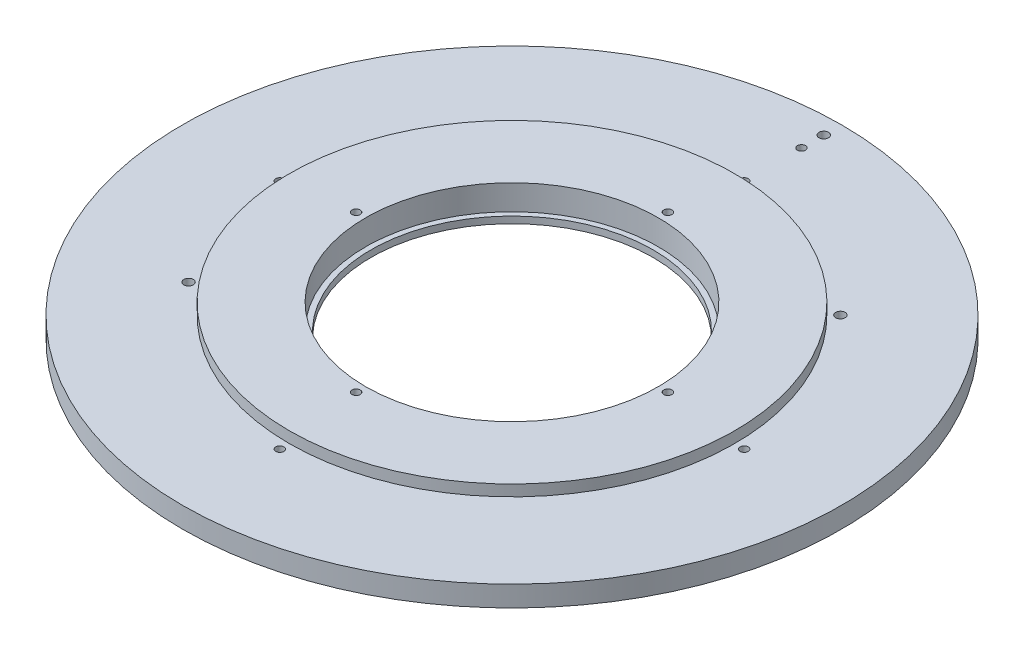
from build123d import *

# Parameters (mm, degrees)
SKETCH3_R          = 164.4579332
BASE_EXTRUDE_DEPTH = 15.875
SKETCH4_R          = 182.5625
SKETCH4_R_2        = 111.125
CUT_EXTRUDE1_DEPTH = 5.55625
SKETCH6_R          = 73.03135
CUT_EXTRUDE2_DEPTH = 12.5476
SKETCH7_R          = 70.4215
CUT_EXTRUDE3_DEPTH = 233.916864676
TAP10_321_D        = 4.0386
TAP10_321_DEPTH    = 24.13
TAP10_321_TIP      = 1.213317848
TAP10_322_D        = 4.0386
TAP10_322_DEPTH    = 24.13
TAP10_322_TIP      = 1.213317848
TAP10_323_D        = 4.0386
TAP10_323_DEPTH    = 24.13
TAP10_323_TIP      = 1.213317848
TAP10_324_D        = 4.0386
TAP10_324_DEPTH    = 24.13
TAP10_324_TIP      = 1.213317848
TAP10_325_D        = 4.0386
TAP10_325_DEPTH    = 24.13
TAP10_325_TIP      = 1.213317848
TAP10_326_D        = 4.0386
TAP10_326_DEPTH    = 24.13
TAP10_326_TIP      = 1.213317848
TAP10_327_D        = 4.0386
TAP10_327_DEPTH    = 24.13
TAP10_327_TIP      = 1.213317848
TAP10_328_D        = 4.0386
TAP10_328_DEPTH    = 24.13
TAP10_328_TIP      = 1.213317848
HOLE9_D            = 4.365625
HOLE9_DEPTH        = 203.2
HOLE9_CBORE_D      = 4.7371
HOLE9_CBORE_DEPTH  = 14.2875
HOLE10_D           = 4.365625
HOLE10_DEPTH       = 203.2
HOLE10_CBORE_D     = 4.7371
HOLE10_CBORE_DEPTH = 14.2875
TAP10_329_D        = 4.0386
TAP10_329_DEPTH    = 24.13
TAP10_329_TIP      = 1.213317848
HOLE13_D           = 4.365625
HOLE13_DEPTH       = 14.2875
HOLE13_CBORE_D     = 4.7879
HOLE13_CBORE_DEPTH = 7.14375
HOLE13_TIP         = 1.31156607


with BuildPart() as part:
    # Sketch3 → Base-Extrude (new body)
    with BuildSketch(Plane(origin=(0, 1203.325, 0), x_dir=(-1, 0, 0), z_dir=(0, 1, 0))):
        with Locations(Location((0, 0, 0), (0, 0, 90))):
            Circle(SKETCH3_R)
    extrude(amount=BASE_EXTRUDE_DEPTH)

    # Sketch4 → Cut-Extrude1 (cut)
    with BuildSketch(Plane(origin=(0, 1219.2, 0), x_dir=(-1, 0, 0), z_dir=(0, 1, 0))):
        Circle(SKETCH4_R)
        with Locations(Location((0, 0, 0), (0, 0, 90))):
            Circle(SKETCH4_R_2, mode=Mode.SUBTRACT)
    extrude(amount=-CUT_EXTRUDE1_DEPTH, mode=Mode.SUBTRACT)

    # Sketch6 → Cut-Extrude2 (cut)
    with BuildSketch(Plane(origin=(0, 1219.2, 0), x_dir=(-1, 0, 0), z_dir=(0, 1, 0))):
        with Locations(Location((0, 0, 0), (0, 0, 90))):
            Circle(SKETCH6_R)
    extrude(amount=-CUT_EXTRUDE2_DEPTH, mode=Mode.SUBTRACT)

    # Sketch7 → Cut-Extrude3 (cut, through all)
    with BuildSketch(Plane(origin=(0, 1206.6524, 0), x_dir=(-1, 0, 0), z_dir=(0, 1, 0))):
        with Locations(Location((0, 0, 0), (0, 0, 90))):
            Circle(SKETCH7_R)
    extrude(amount=-CUT_EXTRUDE3_DEPTH, mode=Mode.SUBTRACT)

    # TAP10-321
    with Locations(Plane(origin=(-78.634775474, 1219.2, 20.274342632), x_dir=(-1, 0, 0), z_dir=(0, 1, 0))):
        with Locations((-0.847275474, -20.274342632)):
            Hole(TAP10_321_D / 2, depth=TAP10_321_DEPTH)
            with Locations((0, 0, -(TAP10_321_DEPTH + TAP10_321_TIP / 2))):  # 118° drill point
                Cone(0, TAP10_321_D / 2, TAP10_321_TIP, mode=Mode.SUBTRACT)

    # TAP10-322
    with Locations(Plane(origin=(11.50472924, 1219.2, 113.710884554), x_dir=(-1, 0, 0), z_dir=(0, 1, 0))):
        with Locations((11.50472924, -35.923384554)):
            Hole(TAP10_322_D / 2, depth=TAP10_322_DEPTH)
            with Locations((0, 0, -(TAP10_322_DEPTH + TAP10_322_TIP / 2))):  # 118° drill point
                Cone(0, TAP10_322_D / 2, TAP10_322_TIP, mode=Mode.SUBTRACT)

    # TAP10-323
    with Locations(Plane(origin=(89.973441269, 1219.2, 37.689853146), x_dir=(-1, 0, 0), z_dir=(0, 1, 0))):
        with Locations((12.185941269, -37.689853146)):
            Hole(TAP10_323_D / 2, depth=TAP10_323_DEPTH)
            with Locations((0, 0, -(TAP10_323_DEPTH + TAP10_323_TIP / 2))):  # 118° drill point
                Cone(0, TAP10_323_D / 2, TAP10_323_TIP, mode=Mode.SUBTRACT)

    # TAP10-324
    with Locations(Plane(origin=(11.243582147, 1219.2, -53.286144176), x_dir=(-1, 0, 0), z_dir=(0, 1, 0))):
        with Locations((11.243582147, -24.501355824)):
            Hole(TAP10_324_D / 2, depth=TAP10_324_DEPTH)
            with Locations((0, 0, -(TAP10_324_DEPTH + TAP10_324_TIP / 2))):  # 118° drill point
                Cone(0, TAP10_324_D / 2, TAP10_324_TIP, mode=Mode.SUBTRACT)

    # TAP10-325
    with Locations(Plane(origin=(9.422599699, 1213.64375, 147.124641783), x_dir=(-1, 0, 0), z_dir=(0, 1, 0))):
        with Locations((9.422599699, -31.237141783)):
            Hole(TAP10_325_D / 2, depth=TAP10_325_DEPTH)
            with Locations((0, 0, -(TAP10_325_DEPTH + TAP10_325_TIP / 2))):  # 118° drill point
                Cone(0, TAP10_325_D / 2, TAP10_325_TIP, mode=Mode.SUBTRACT)

    # TAP10-326
    with Locations(Plane(origin=(122.114111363, 1213.64375, 30.988319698), x_dir=(-1, 0, 0), z_dir=(0, 1, 0))):
        with Locations((6.226611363, -30.988319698)):
            Hole(TAP10_326_D / 2, depth=TAP10_326_DEPTH)
            with Locations((0, 0, -(TAP10_326_DEPTH + TAP10_326_TIP / 2))):  # 118° drill point
                Cone(0, TAP10_326_D / 2, TAP10_326_TIP, mode=Mode.SUBTRACT)

    # TAP10-327
    with Locations(Plane(origin=(7.463888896, 1213.64375, -88.482536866), x_dir=(-1, 0, 0), z_dir=(0, 1, 0))):
        with Locations((7.463888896, -27.404963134)):
            Hole(TAP10_327_D / 2, depth=TAP10_327_DEPTH)
            with Locations((0, 0, -(TAP10_327_DEPTH + TAP10_327_TIP / 2))):  # 118° drill point
                Cone(0, TAP10_327_D / 2, TAP10_327_TIP, mode=Mode.SUBTRACT)

    # TAP10-328
    with Locations(Plane(origin=(-113.643602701, 1213.64375, 30.817654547), x_dir=(-1, 0, 0), z_dir=(0, 1, 0))):
        with Locations((2.243897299, -30.817654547)):
            Hole(TAP10_328_D / 2, depth=TAP10_328_DEPTH)
            with Locations((0, 0, -(TAP10_328_DEPTH + TAP10_328_TIP / 2))):  # 118° drill point
                Cone(0, TAP10_328_D / 2, TAP10_328_TIP, mode=Mode.SUBTRACT)

    # Hole9
    with Locations(Plane(origin=(95.279391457, 1213.64375, -58.290093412), x_dir=(-1, 0, 0), z_dir=(0, 1, 0))):
        with Locations((13.334554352, -23.654743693)):
            CounterBoreHole(HOLE9_D / 2, HOLE9_CBORE_D / 2, HOLE9_CBORE_DEPTH, depth=HOLE9_DEPTH)

    # Hole10
    with Locations(Plane(origin=(-97.262405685, 1213.64375, 91.550407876), x_dir=(-1, 0, 0), z_dir=(0, 1, 0))):
        with Locations((-2.332923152, -25.080068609)):
            CounterBoreHole(HOLE10_D / 2, HOLE10_CBORE_D / 2, HOLE10_CBORE_DEPTH, depth=HOLE10_DEPTH)

    # TAP10-329
    with Locations(Plane(origin=(-7.506670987, 1213.64375, -118.718492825), x_dir=(-1, 0, 0), z_dir=(0, 1, 0))):
        with Locations((-7.506670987, -25.744007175)):
            Hole(TAP10_329_D / 2, depth=TAP10_329_DEPTH)
            with Locations((0, 0, -(TAP10_329_DEPTH + TAP10_329_TIP / 2))):  # 118° drill point
                Cone(0, TAP10_329_D / 2, TAP10_329_TIP, mode=Mode.SUBTRACT)

    # Hole13
    with Locations(Plane(origin=(-6.098933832, 1213.64375, -128.761451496), x_dir=(-1, 0, 0), z_dir=(0, 1, 0))):
        with Locations((-6.098933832, -26.813548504)):
            CounterBoreHole(HOLE13_D / 2, HOLE13_CBORE_D / 2, HOLE13_CBORE_DEPTH, depth=HOLE13_DEPTH)
            with Locations((0, 0, -(HOLE13_DEPTH + HOLE13_TIP / 2))):  # 118° drill point
                Cone(0, HOLE13_D / 2, HOLE13_TIP, mode=Mode.SUBTRACT)


solid = part.part
